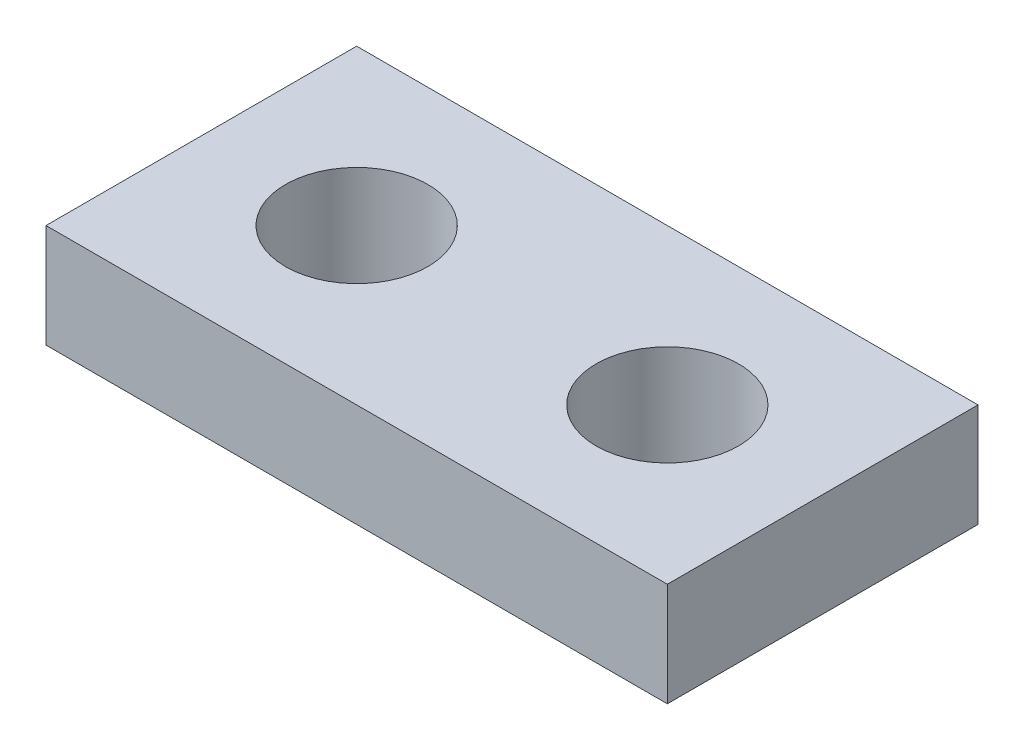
ISO-10303-21;
HEADER;
FILE_DESCRIPTION(('STEP AP214'),'2;1');
FILE_NAME('part.step','',(''),(''),'','','');
FILE_SCHEMA(('AUTOMOTIVE_DESIGN { 1 0 10303 214 1 1 1 1 }'));
ENDSEC;
DATA;
#1=APPLICATION_CONTEXT('core data for automotive mechanical design processes');
#2=APPLICATION_PROTOCOL_DEFINITION('international standard','automotive_design',2000,#1);
#3=PRODUCT_CONTEXT('',#1,'mechanical');
#4=PRODUCT('Part','Part','',(#3));
#5=PRODUCT_RELATED_PRODUCT_CATEGORY('part','',(#4));
#6=PRODUCT_DEFINITION_FORMATION('','',#4);
#7=PRODUCT_DEFINITION_CONTEXT('part definition',#1,'design');
#8=PRODUCT_DEFINITION('design','',#6,#7);
#9=PRODUCT_DEFINITION_SHAPE('','',#8);
#10=(LENGTH_UNIT() NAMED_UNIT(*) SI_UNIT(.MILLI.,.METRE.));
#11=(NAMED_UNIT(*) PLANE_ANGLE_UNIT() SI_UNIT($,.RADIAN.));
#12=(NAMED_UNIT(*) SI_UNIT($,.STERADIAN.) SOLID_ANGLE_UNIT());
#13=UNCERTAINTY_MEASURE_WITH_UNIT(LENGTH_MEASURE(1.E-05),#10,'distance_accuracy_value','');
#14=(GEOMETRIC_REPRESENTATION_CONTEXT(3) GLOBAL_UNCERTAINTY_ASSIGNED_CONTEXT((#13)) GLOBAL_UNIT_ASSIGNED_CONTEXT((#10,
#11,#12)) REPRESENTATION_CONTEXT('',''));
#15=CARTESIAN_POINT('',(0.,0.,0.));
#16=DIRECTION('',(0.,0.,1.));
#17=DIRECTION('',(1.,0.,0.));
#18=AXIS2_PLACEMENT_3D('',#15,#16,#17);
#19=CARTESIAN_POINT('',(38.1,-12.7,19.05));
#20=DIRECTION('',(1.,0.,0.));
#21=DIRECTION('',(0.,0.,-1.));
#22=AXIS2_PLACEMENT_3D('',#19,#20,#21);
#23=PLANE('',#22);
#24=DIRECTION('',(0.,0.,-1.));
#25=VECTOR('',#24,1.);
#26=CARTESIAN_POINT('',(38.1,0.,19.05));
#27=LINE('',#26,#25);
#28=CARTESIAN_POINT('',(38.1,0.,19.05));
#29=VERTEX_POINT('',#28);
#30=CARTESIAN_POINT('',(38.1,0.,-19.05));
#31=VERTEX_POINT('',#30);
#32=EDGE_CURVE('E107',#29,#31,#27,.T.);
#33=ORIENTED_EDGE('',*,*,#32,.F.);
#34=DIRECTION('',(0.,1.,0.));
#35=VECTOR('',#34,1.);
#36=CARTESIAN_POINT('',(38.1,-12.7,19.05));
#37=LINE('',#36,#35);
#38=CARTESIAN_POINT('',(38.1,-12.7,19.05));
#39=VERTEX_POINT('',#38);
#40=EDGE_CURVE('E12',#39,#29,#37,.T.);
#41=ORIENTED_EDGE('',*,*,#40,.F.);
#42=DIRECTION('',(0.,0.,-1.));
#43=VECTOR('',#42,1.);
#44=CARTESIAN_POINT('',(38.1,-12.7,19.05));
#45=LINE('',#44,#43);
#46=CARTESIAN_POINT('',(38.1,-12.7,-19.05));
#47=VERTEX_POINT('',#46);
#48=EDGE_CURVE('E101',#39,#47,#45,.T.);
#49=ORIENTED_EDGE('',*,*,#48,.T.);
#50=DIRECTION('',(0.,1.,0.));
#51=VECTOR('',#50,1.);
#52=CARTESIAN_POINT('',(38.1,-12.7,-19.05));
#53=LINE('',#52,#51);
#54=EDGE_CURVE('E46',#47,#31,#53,.T.);
#55=ORIENTED_EDGE('',*,*,#54,.T.);
#56=EDGE_LOOP('',(#33,#41,#49,#55));
#57=FACE_BOUND('',#56,.T.);
#58=ADVANCED_FACE('F43',(#57),#23,.T.);
#59=CARTESIAN_POINT('',(-38.1,-12.7,19.05));
#60=DIRECTION('',(0.,0.,1.));
#61=DIRECTION('',(1.,0.,0.));
#62=AXIS2_PLACEMENT_3D('',#59,#60,#61);
#63=PLANE('',#62);
#64=DIRECTION('',(1.,0.,0.));
#65=VECTOR('',#64,1.);
#66=CARTESIAN_POINT('',(-38.1,0.,19.05));
#67=LINE('',#66,#65);
#68=CARTESIAN_POINT('',(-38.1,0.,19.05));
#69=VERTEX_POINT('',#68);
#70=EDGE_CURVE('E103',#69,#29,#67,.T.);
#71=ORIENTED_EDGE('',*,*,#70,.F.);
#72=DIRECTION('',(0.,1.,0.));
#73=VECTOR('',#72,1.);
#74=CARTESIAN_POINT('',(-38.1,-12.7,19.05));
#75=LINE('',#74,#73);
#76=CARTESIAN_POINT('',(-38.1,-12.7,19.05));
#77=VERTEX_POINT('',#76);
#78=EDGE_CURVE('E52',#77,#69,#75,.T.);
#79=ORIENTED_EDGE('',*,*,#78,.F.);
#80=DIRECTION('',(1.,0.,0.));
#81=VECTOR('',#80,1.);
#82=CARTESIAN_POINT('',(-38.1,-12.7,19.05));
#83=LINE('',#82,#81);
#84=EDGE_CURVE('E98',#77,#39,#83,.T.);
#85=ORIENTED_EDGE('',*,*,#84,.T.);
#86=ORIENTED_EDGE('',*,*,#40,.T.);
#87=EDGE_LOOP('',(#71,#79,#85,#86));
#88=FACE_BOUND('',#87,.T.);
#89=ADVANCED_FACE('F118',(#88),#63,.T.);
#90=CARTESIAN_POINT('',(-38.1,-12.7,19.05));
#91=DIRECTION('',(-1.,0.,0.));
#92=DIRECTION('',(0.,0.,1.));
#93=AXIS2_PLACEMENT_3D('',#90,#91,#92);
#94=PLANE('',#93);
#95=DIRECTION('',(0.,0.,1.));
#96=VECTOR('',#95,1.);
#97=CARTESIAN_POINT('',(-38.1,0.,19.05));
#98=LINE('',#97,#96);
#99=CARTESIAN_POINT('',(-38.1,0.,-19.05));
#100=VERTEX_POINT('',#99);
#101=EDGE_CURVE('E93',#100,#69,#98,.T.);
#102=ORIENTED_EDGE('',*,*,#101,.F.);
#103=DIRECTION('',(0.,1.,0.));
#104=VECTOR('',#103,1.);
#105=CARTESIAN_POINT('',(-38.1,-12.7,-19.05));
#106=LINE('',#105,#104);
#107=CARTESIAN_POINT('',(-38.1,-12.7,-19.05));
#108=VERTEX_POINT('',#107);
#109=EDGE_CURVE('E88',#108,#100,#106,.T.);
#110=ORIENTED_EDGE('',*,*,#109,.F.);
#111=DIRECTION('',(0.,0.,1.));
#112=VECTOR('',#111,1.);
#113=CARTESIAN_POINT('',(-38.1,-12.7,19.05));
#114=LINE('',#113,#112);
#115=EDGE_CURVE('E91',#108,#77,#114,.T.);
#116=ORIENTED_EDGE('',*,*,#115,.T.);
#117=ORIENTED_EDGE('',*,*,#78,.T.);
#118=EDGE_LOOP('',(#102,#110,#116,#117));
#119=FACE_BOUND('',#118,.T.);
#120=ADVANCED_FACE('F90',(#119),#94,.T.);
#121=CARTESIAN_POINT('',(-38.1,-12.7,-19.05));
#122=DIRECTION('',(0.,0.,-1.));
#123=DIRECTION('',(-1.,0.,0.));
#124=AXIS2_PLACEMENT_3D('',#121,#122,#123);
#125=PLANE('',#124);
#126=DIRECTION('',(-1.,0.,0.));
#127=VECTOR('',#126,1.);
#128=CARTESIAN_POINT('',(-38.1,0.,-19.05));
#129=LINE('',#128,#127);
#130=EDGE_CURVE('E110',#31,#100,#129,.T.);
#131=ORIENTED_EDGE('',*,*,#130,.F.);
#132=ORIENTED_EDGE('',*,*,#54,.F.);
#133=DIRECTION('',(-1.,0.,0.));
#134=VECTOR('',#133,1.);
#135=CARTESIAN_POINT('',(-38.1,-12.7,-19.05));
#136=LINE('',#135,#134);
#137=EDGE_CURVE('E97',#47,#108,#136,.T.);
#138=ORIENTED_EDGE('',*,*,#137,.T.);
#139=ORIENTED_EDGE('',*,*,#109,.T.);
#140=EDGE_LOOP('',(#131,#132,#138,#139));
#141=FACE_BOUND('',#140,.T.);
#142=ADVANCED_FACE('F100',(#141),#125,.T.);
#143=CARTESIAN_POINT('',(0.,-12.7,0.));
#144=DIRECTION('',(0.,-1.,0.));
#145=DIRECTION('',(0.,0.,-1.));
#146=AXIS2_PLACEMENT_3D('',#143,#144,#145);
#147=PLANE('',#146);
#148=CARTESIAN_POINT('',(19.05,-12.7,0.));
#149=DIRECTION('',(0.,1.,0.));
#150=DIRECTION('',(0.,0.,1.));
#151=AXIS2_PLACEMENT_3D('',#148,#149,#150);
#152=CIRCLE('',#151,8.73124999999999);
#153=CARTESIAN_POINT('',(19.05,-12.7,8.73124999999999));
#154=VERTEX_POINT('',#153);
#155=EDGE_CURVE('E151',#154,#154,#152,.T.);
#156=ORIENTED_EDGE('',*,*,#155,.T.);
#157=EDGE_LOOP('',(#156));
#158=FACE_BOUND('',#157,.T.);
#159=CARTESIAN_POINT('',(-19.05,-12.7,0.));
#160=DIRECTION('',(0.,1.,0.));
#161=DIRECTION('',(0.,0.,1.));
#162=AXIS2_PLACEMENT_3D('',#159,#160,#161);
#163=CIRCLE('',#162,8.73125);
#164=CARTESIAN_POINT('',(-19.05,-12.7,8.73125));
#165=VERTEX_POINT('',#164);
#166=EDGE_CURVE('E111',#165,#165,#163,.T.);
#167=ORIENTED_EDGE('',*,*,#166,.T.);
#168=EDGE_LOOP('',(#167));
#169=FACE_BOUND('',#168,.T.);
#170=ORIENTED_EDGE('',*,*,#48,.F.);
#171=ORIENTED_EDGE('',*,*,#84,.F.);
#172=ORIENTED_EDGE('',*,*,#115,.F.);
#173=ORIENTED_EDGE('',*,*,#137,.F.);
#174=EDGE_LOOP('',(#170,#171,#172,#173));
#175=FACE_BOUND('',#174,.T.);
#176=ADVANCED_FACE('F96',(#158,#169,#175),#147,.T.);
#177=CARTESIAN_POINT('',(0.,0.,0.));
#178=DIRECTION('',(0.,-1.,0.));
#179=DIRECTION('',(0.,0.,-1.));
#180=AXIS2_PLACEMENT_3D('',#177,#178,#179);
#181=PLANE('',#180);
#182=CARTESIAN_POINT('',(19.05,0.,0.));
#183=DIRECTION('',(0.,1.,0.));
#184=DIRECTION('',(0.,0.,1.));
#185=AXIS2_PLACEMENT_3D('',#182,#183,#184);
#186=CIRCLE('',#185,8.73124999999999);
#187=CARTESIAN_POINT('',(19.05,0.,8.73124999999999));
#188=VERTEX_POINT('',#187);
#189=EDGE_CURVE('E154',#188,#188,#186,.T.);
#190=ORIENTED_EDGE('',*,*,#189,.F.);
#191=EDGE_LOOP('',(#190));
#192=FACE_BOUND('',#191,.T.);
#193=CARTESIAN_POINT('',(-19.05,0.,0.));
#194=DIRECTION('',(0.,1.,0.));
#195=DIRECTION('',(0.,0.,1.));
#196=AXIS2_PLACEMENT_3D('',#193,#194,#195);
#197=CIRCLE('',#196,8.73125);
#198=CARTESIAN_POINT('',(-19.05,0.,8.73125));
#199=VERTEX_POINT('',#198);
#200=EDGE_CURVE('E156',#199,#199,#197,.T.);
#201=ORIENTED_EDGE('',*,*,#200,.F.);
#202=EDGE_LOOP('',(#201));
#203=FACE_BOUND('',#202,.T.);
#204=ORIENTED_EDGE('',*,*,#32,.T.);
#205=ORIENTED_EDGE('',*,*,#130,.T.);
#206=ORIENTED_EDGE('',*,*,#101,.T.);
#207=ORIENTED_EDGE('',*,*,#70,.T.);
#208=EDGE_LOOP('',(#204,#205,#206,#207));
#209=FACE_BOUND('',#208,.T.);
#210=ADVANCED_FACE('F117',(#192,#203,#209),#181,.F.);
#211=CARTESIAN_POINT('',(-19.05,-12.7,0.));
#212=DIRECTION('',(0.,1.,0.));
#213=DIRECTION('',(0.,0.,1.));
#214=AXIS2_PLACEMENT_3D('',#211,#212,#213);
#215=CYLINDRICAL_SURFACE('',#214,8.73125);
#216=ORIENTED_EDGE('',*,*,#166,.F.);
#217=EDGE_LOOP('',(#216));
#218=FACE_BOUND('',#217,.T.);
#219=ORIENTED_EDGE('',*,*,#200,.T.);
#220=EDGE_LOOP('',(#219));
#221=FACE_BOUND('',#220,.T.);
#222=ADVANCED_FACE('F136',(#218,#221),#215,.F.);
#223=CARTESIAN_POINT('',(19.05,0.,0.));
#224=DIRECTION('',(0.,1.,0.));
#225=DIRECTION('',(0.,0.,1.));
#226=AXIS2_PLACEMENT_3D('',#223,#224,#225);
#227=CYLINDRICAL_SURFACE('',#226,8.73124999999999);
#228=ORIENTED_EDGE('',*,*,#155,.F.);
#229=EDGE_LOOP('',(#228));
#230=FACE_BOUND('',#229,.T.);
#231=ORIENTED_EDGE('',*,*,#189,.T.);
#232=EDGE_LOOP('',(#231));
#233=FACE_BOUND('',#232,.T.);
#234=ADVANCED_FACE('F143',(#230,#233),#227,.F.);
#235=CLOSED_SHELL('',(#58,#89,#120,#142,#176,#210,#222,#234));
#236=MANIFOLD_SOLID_BREP('B2',#235);
#237=ADVANCED_BREP_SHAPE_REPRESENTATION('',(#18,#236),#14);
#238=SHAPE_DEFINITION_REPRESENTATION(#9,#237);
ENDSEC;
END-ISO-10303-21;
